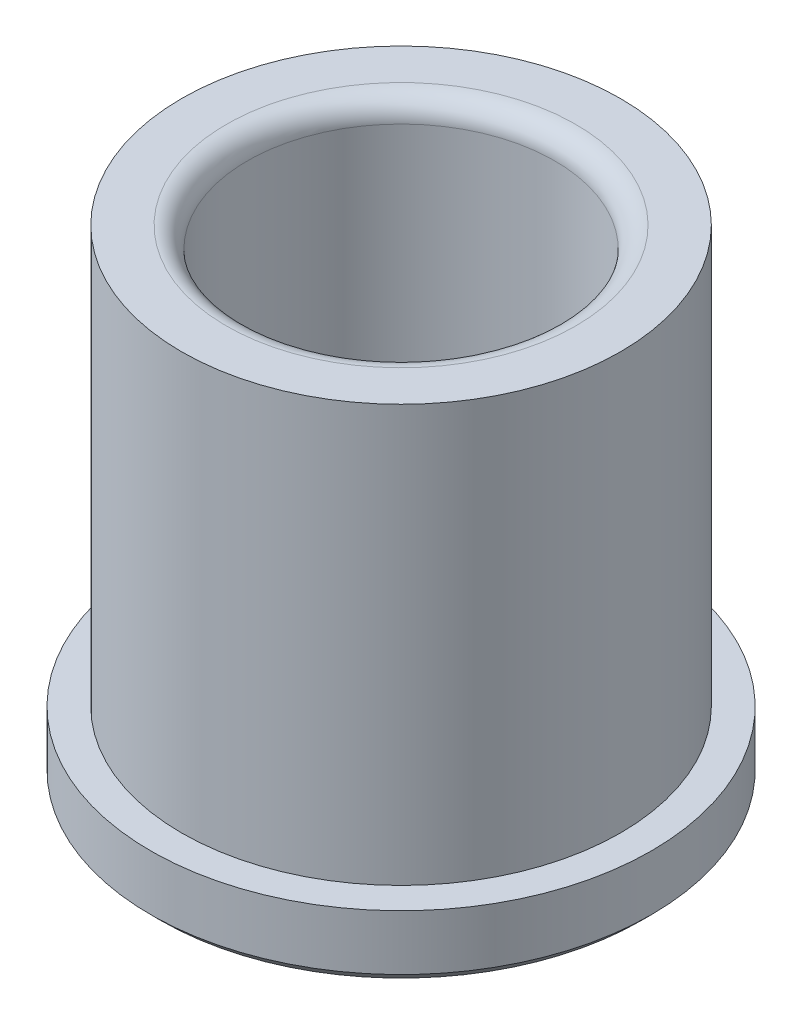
from build123d import *

# Parameters (mm, degrees)
FILLET1_R = 1.524


with BuildPart() as part:
    # Sketch1 → Revolve1 (revolve)
    with BuildSketch(Plane.XY, mode=Mode.PRIVATE) as revolve1_sk:
        Polygon((-17.3609, 0), (-18.1229, 0.762), (-18.1229, 4.7625), (-15.88135, 4.7625), (-15.88135, 34.925), (-11.11885, 34.925), (-11.11885, 0.762), (-11.88085, 0), align=None)
    revolve(revolve1_sk.sketch.rotate(Axis((0, -1000, 0), (0, 1, 0)), 180), axis=Axis((0, -1000, 0), (0, 1, 0)))

    # Fillet1
    fillet1_edges = [part.edges().sort_by_distance(p)[0] for p in [
        (-11.11885, 34.925, 0),
    ]]
    fillet(fillet1_edges, radius=FILLET1_R)


solid = part.part
